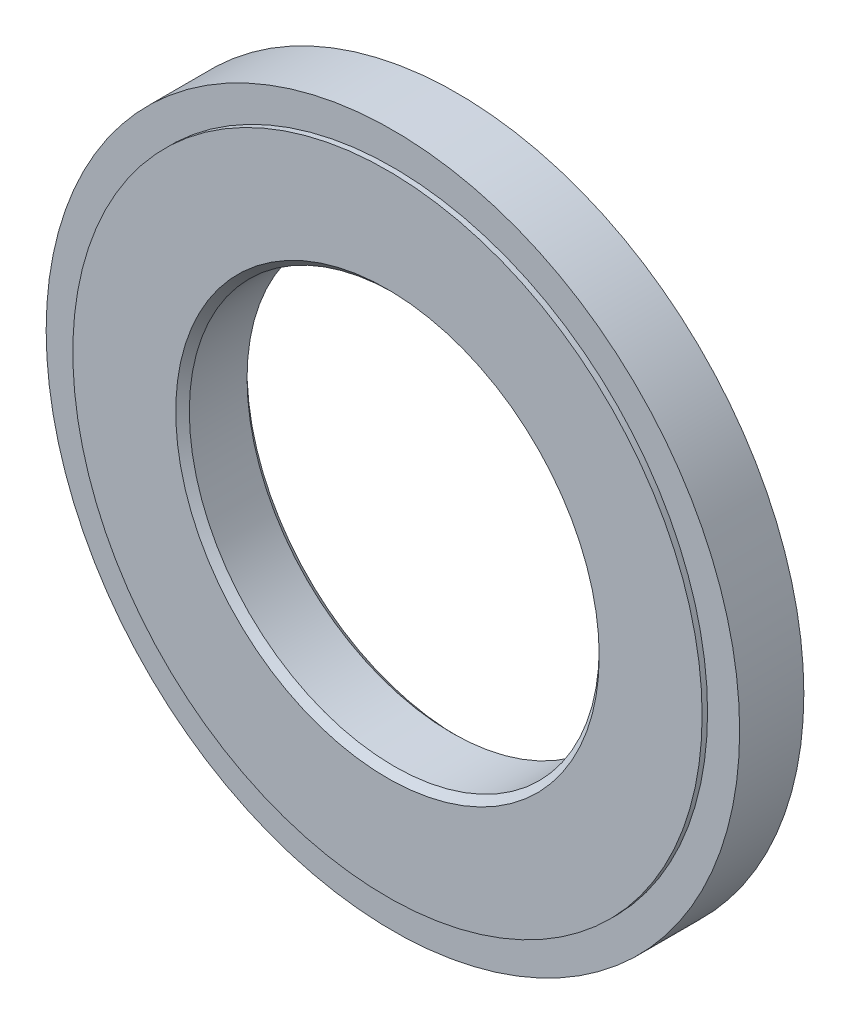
from build123d import *

# Parameters (mm, degrees)
SKETCH1_R                      = 102.1
EXTRUDE1_DEPTH                 = 10.5
SKETCH2_R                      = 102.1
SKETCH2_R_2                    = 92.65
CUT_EXTRUDE1_DEPTH             = 1.6
CUT_EXTRUDE2_START             = -0.5
SKETCH3_R                      = 102.1
SKETCH3_R_2                    = 92.65
CUT_EXTRUDE2_DEPTH             = 0.5
SKETCH4_R                      = 60.35
CUT_EXTRUDE3_DEPTH             = 146.91031492
CHAMFER1_SIZE                  = 2
F_3_2_3_2_DIAMETER_HOLE1_D     = 3.2
F_3_2_3_2_DIAMETER_HOLE1_DEPTH = 4.8
M6X1_0_TAPPED_HOLE1_D          = 5
M6X1_0_TAPPED_HOLE1_DEPTH      = 12.7
M6X1_0_TAPPED_HOLE1_TIP        = 1.502151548


with BuildPart() as part:
    # Sketch1 → Extrude1 (new, symmetric)
    with BuildSketch(Plane.XY):
        with Locations(Location((0, 0, 0), (0, 0, 180))):
            Circle(SKETCH1_R)
    extrude(amount=EXTRUDE1_DEPTH, both=True)

    # Sketch2 → Cut-Extrude1 (cut)
    with BuildSketch(Plane.XY.offset(10.5)):
        with Locations(Location((0, 0, 0), (0, 0, 180))):
            Circle(SKETCH2_R)
        Circle(SKETCH2_R_2, mode=Mode.SUBTRACT)
    extrude(amount=-CUT_EXTRUDE1_DEPTH, mode=Mode.SUBTRACT)

    # Sketch3 → Cut-Extrude2 (cut)
    with BuildSketch(Plane(origin=(0, 0, -10.5), x_dir=(-1, 0, 0), z_dir=(0, 0, -1)).offset(CUT_EXTRUDE2_START)):
        Circle(SKETCH3_R)
        with Locations(Location((0, 0, 0), (0, 0, 180))):
            Circle(SKETCH3_R_2, mode=Mode.SUBTRACT)
    extrude(amount=CUT_EXTRUDE2_DEPTH, mode=Mode.SUBTRACT)

    # Sketch4 → Cut-Extrude3 (cut, through all)
    with BuildSketch(Plane.XY.offset(10.5)):
        Circle(SKETCH4_R)
    extrude(amount=-CUT_EXTRUDE3_DEPTH, mode=Mode.SUBTRACT)

    # Chamfer1
    chamfer1_edges = [part.edges().sort_by_distance(p)[0] for p in [
        (-60.35, 0, -10.5),
        (-60.35, 0, 10.5),
    ]]
    chamfer(chamfer1_edges, length=CHAMFER1_SIZE)

    # 3.2 _3.2_ Diameter Hole1
    with Locations(Plane(origin=(0, 76.2, -10.5), x_dir=(-1, 0, 0), z_dir=(0, 0, -1))):
        with Locations((0, 0), (0, -152.4)):
            Hole(F_3_2_3_2_DIAMETER_HOLE1_D / 2, depth=F_3_2_3_2_DIAMETER_HOLE1_DEPTH)

    # M6x1.0 Tapped Hole1
    with Locations(Plane(origin=(53.88153673, 53.88153673, -10.5), x_dir=(-1, 0, 0), z_dir=(0, 0, -1))):
        with Locations((0, 0), (107.76307346, 0), (107.76307346, -107.76307346), (0, -107.76307346)):
            Hole(M6X1_0_TAPPED_HOLE1_D / 2, depth=M6X1_0_TAPPED_HOLE1_DEPTH)
            with Locations((0, 0, -(M6X1_0_TAPPED_HOLE1_DEPTH + M6X1_0_TAPPED_HOLE1_TIP / 2))):  # 118° drill point
                Cone(0, M6X1_0_TAPPED_HOLE1_D / 2, M6X1_0_TAPPED_HOLE1_TIP, mode=Mode.SUBTRACT)


solid = part.part
